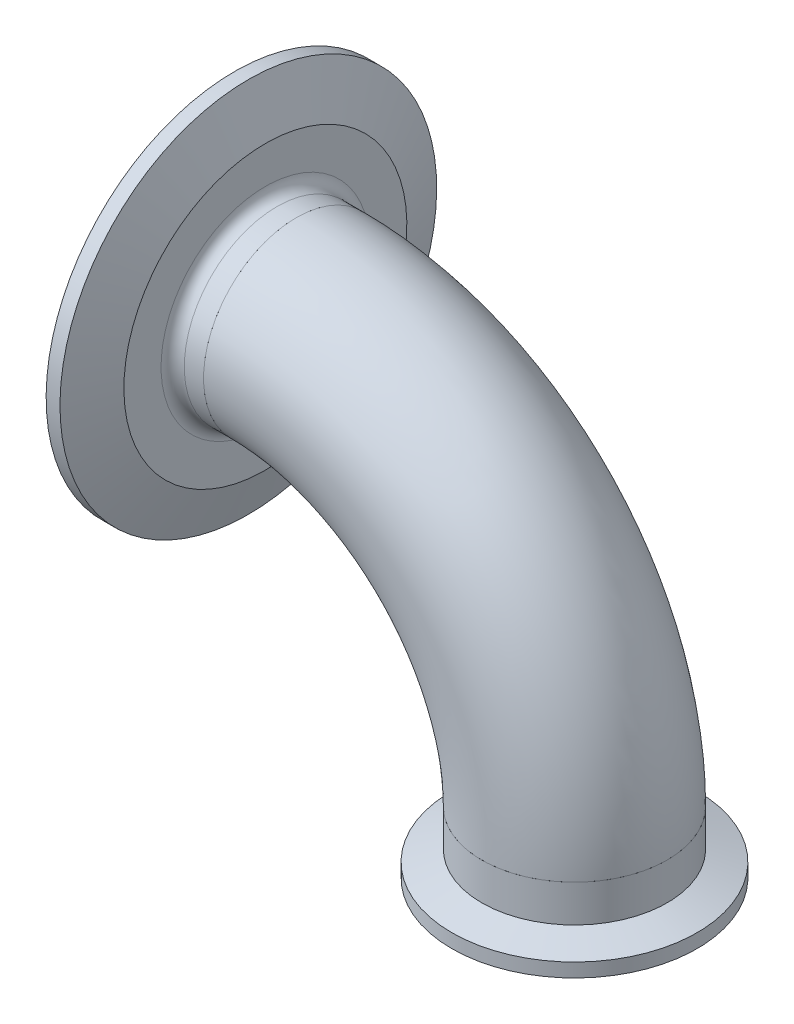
ISO-10303-21;
HEADER;
FILE_DESCRIPTION(('STEP AP214'),'2;1');
FILE_NAME('part.step','',(''),(''),'','','');
FILE_SCHEMA(('AUTOMOTIVE_DESIGN { 1 0 10303 214 1 1 1 1 }'));
ENDSEC;
DATA;
#1=APPLICATION_CONTEXT('core data for automotive mechanical design processes');
#2=APPLICATION_PROTOCOL_DEFINITION('international standard','automotive_design',2000,#1);
#3=PRODUCT_CONTEXT('',#1,'mechanical');
#4=PRODUCT('Part','Part','',(#3));
#5=PRODUCT_RELATED_PRODUCT_CATEGORY('part','',(#4));
#6=PRODUCT_DEFINITION_FORMATION('','',#4);
#7=PRODUCT_DEFINITION_CONTEXT('part definition',#1,'design');
#8=PRODUCT_DEFINITION('design','',#6,#7);
#9=PRODUCT_DEFINITION_SHAPE('','',#8);
#10=(LENGTH_UNIT() NAMED_UNIT(*) SI_UNIT(.MILLI.,.METRE.));
#11=(NAMED_UNIT(*) PLANE_ANGLE_UNIT() SI_UNIT($,.RADIAN.));
#12=(NAMED_UNIT(*) SI_UNIT($,.STERADIAN.) SOLID_ANGLE_UNIT());
#13=UNCERTAINTY_MEASURE_WITH_UNIT(LENGTH_MEASURE(1.E-05),#10,'distance_accuracy_value','');
#14=(GEOMETRIC_REPRESENTATION_CONTEXT(3) GLOBAL_UNCERTAINTY_ASSIGNED_CONTEXT((#13)) GLOBAL_UNIT_ASSIGNED_CONTEXT((#10,
#11,#12)) REPRESENTATION_CONTEXT('',''));
#15=CARTESIAN_POINT('',(0.,0.,0.));
#16=DIRECTION('',(0.,0.,1.));
#17=DIRECTION('',(1.,0.,0.));
#18=AXIS2_PLACEMENT_3D('',#15,#16,#17);
#19=CARTESIAN_POINT('',(8.93718359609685,90.2785456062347,94.8178450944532));
#20=DIRECTION('',(-1.,0.,0.));
#21=DIRECTION('',(0.,0.82925359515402,-0.558872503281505));
#22=AXIS2_PLACEMENT_3D('',#19,#20,#21);
#23=PLANE('',#22);
#24=CARTESIAN_POINT('',(8.93718359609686,80.3275971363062,80.0526531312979));
#25=DIRECTION('',(-1.,0.,0.));
#26=DIRECTION('',(0.,0.82925359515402,-0.558872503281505));
#27=AXIS2_PLACEMENT_3D('',#24,#25,#26);
#28=CIRCLE('',#27,19.05);
#29=CARTESIAN_POINT('',(8.93718359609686,96.1248781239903,69.4061319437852));
#30=VERTEX_POINT('',#29);
#31=EDGE_CURVE('P0_E9',#30,#30,#28,.T.);
#32=ORIENTED_EDGE('',*,*,#31,.F.);
#33=EDGE_LOOP('',(#32));
#34=FACE_BOUND('',#33,.T.);
#35=CARTESIAN_POINT('',(8.93718359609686,80.3275971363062,80.0526531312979));
#36=DIRECTION('',(-1.,0.,0.));
#37=DIRECTION('',(0.,0.82925359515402,-0.558872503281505));
#38=AXIS2_PLACEMENT_3D('',#35,#36,#37);
#39=CIRCLE('',#38,17.8054);
#40=CARTESIAN_POINT('',(8.93718359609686,95.0927890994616,70.1017046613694));
#41=VERTEX_POINT('',#40);
#42=EDGE_CURVE('P0_E63',#41,#41,#39,.T.);
#43=ORIENTED_EDGE('',*,*,#42,.T.);
#44=EDGE_LOOP('',(#43));
#45=FACE_BOUND('',#44,.T.);
#46=ADVANCED_FACE('P0_F14',(#34,#45),#23,.F.);
#47=CARTESIAN_POINT('',(-3.76281640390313,80.3275971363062,80.0526531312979));
#48=DIRECTION('',(-1.,0.,0.));
#49=DIRECTION('',(0.,0.82925359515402,-0.558872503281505));
#50=AXIS2_PLACEMENT_3D('',#47,#48,#49);
#51=CYLINDRICAL_SURFACE('',#50,19.05);
#52=CARTESIAN_POINT('',(4.97478359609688,80.3275971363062,80.0526531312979));
#53=DIRECTION('',(-1.,0.,0.));
#54=DIRECTION('',(0.,0.82925359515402,-0.558872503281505));
#55=AXIS2_PLACEMENT_3D('',#52,#53,#54);
#56=CIRCLE('',#55,19.05);
#57=CARTESIAN_POINT('',(4.97478359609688,96.1248781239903,69.4061319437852));
#58=VERTEX_POINT('',#57);
#59=EDGE_CURVE('P0_E20',#58,#58,#56,.T.);
#60=ORIENTED_EDGE('',*,*,#59,.F.);
#61=EDGE_LOOP('',(#60));
#62=FACE_BOUND('',#61,.T.);
#63=ORIENTED_EDGE('',*,*,#31,.T.);
#64=EDGE_LOOP('',(#63));
#65=FACE_BOUND('',#64,.T.);
#66=ADVANCED_FACE('P0_F142',(#62,#65),#51,.T.);
#67=CARTESIAN_POINT('',(4.97478359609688,80.3275971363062,80.0526531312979));
#68=DIRECTION('',(-1.,0.,0.));
#69=DIRECTION('',(0.,0.82925359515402,-0.558872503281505));
#70=AXIS2_PLACEMENT_3D('',#67,#68,#69);
#71=TOROIDAL_SURFACE('',#70,21.4376,2.3876);
#72=CARTESIAN_POINT('',(2.58718359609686,80.3275971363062,80.0526531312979));
#73=DIRECTION('',(-1.,0.,0.));
#74=DIRECTION('',(0.,0.82925359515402,-0.558872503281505));
#75=AXIS2_PLACEMENT_3D('',#72,#73,#74);
#76=CIRCLE('',#75,21.4376);
#77=CARTESIAN_POINT('',(2.58718359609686,98.10480400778,68.0717679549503));
#78=VERTEX_POINT('',#77);
#79=EDGE_CURVE('P0_E24',#78,#78,#76,.T.);
#80=ORIENTED_EDGE('',*,*,#79,.F.);
#81=EDGE_LOOP('',(#80));
#82=FACE_BOUND('',#81,.T.);
#83=ORIENTED_EDGE('',*,*,#59,.T.);
#84=EDGE_LOOP('',(#83));
#85=FACE_BOUND('',#84,.T.);
#86=ADVANCED_FACE('P0_F137',(#82,#85),#71,.F.);
#87=CARTESIAN_POINT('',(2.58718359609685,92.3084823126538,97.8298600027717));
#88=DIRECTION('',(-1.,0.,0.));
#89=DIRECTION('',(0.,0.82925359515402,-0.558872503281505));
#90=AXIS2_PLACEMENT_3D('',#87,#88,#89);
#91=PLANE('',#90);
#92=CARTESIAN_POINT('',(2.58718359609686,80.3275971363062,80.0526531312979));
#93=DIRECTION('',(-1.,0.,0.));
#94=DIRECTION('',(0.,0.82925359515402,-0.558872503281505));
#95=AXIS2_PLACEMENT_3D('',#92,#93,#94);
#96=CIRCLE('',#95,29.0664421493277);
#97=CARTESIAN_POINT('',(2.58718359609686,104.431048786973,63.8082178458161));
#98=VERTEX_POINT('',#97);
#99=EDGE_CURVE('P0_E28',#98,#98,#96,.T.);
#100=ORIENTED_EDGE('',*,*,#99,.F.);
#101=EDGE_LOOP('',(#100));
#102=FACE_BOUND('',#101,.T.);
#103=ORIENTED_EDGE('',*,*,#79,.T.);
#104=EDGE_LOOP('',(#103));
#105=FACE_BOUND('',#104,.T.);
#106=ADVANCED_FACE('P0_F131',(#102,#105),#91,.F.);
#107=CARTESIAN_POINT('',(2.58718359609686,80.3275971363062,80.0526531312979));
#108=DIRECTION('',(-1.,0.,0.));
#109=DIRECTION('',(0.,0.82925359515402,-0.558872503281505));
#110=AXIS2_PLACEMENT_3D('',#107,#108,#109);
#111=CONICAL_SURFACE('',#110,29.0664421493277,1.22173047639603);
#112=CARTESIAN_POINT('',(-0.918016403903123,80.3275971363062,80.0526531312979));
#113=DIRECTION('',(-1.,0.,0.));
#114=DIRECTION('',(0.,0.82925359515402,-0.558872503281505));
#115=AXIS2_PLACEMENT_3D('',#112,#113,#114);
#116=CIRCLE('',#115,38.6969);
#117=CARTESIAN_POINT('',(-0.918016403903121,112.417140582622,58.4260197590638));
#118=VERTEX_POINT('',#117);
#119=EDGE_CURVE('P0_E33',#118,#118,#116,.T.);
#120=ORIENTED_EDGE('',*,*,#119,.F.);
#121=EDGE_LOOP('',(#120));
#122=FACE_BOUND('',#121,.T.);
#123=ORIENTED_EDGE('',*,*,#99,.T.);
#124=EDGE_LOOP('',(#123));
#125=FACE_BOUND('',#124,.T.);
#126=ADVANCED_FACE('P0_F125',(#122,#125),#111,.T.);
#127=CARTESIAN_POINT('',(-3.76281640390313,80.3275971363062,80.0526531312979));
#128=DIRECTION('',(-1.,0.,0.));
#129=DIRECTION('',(0.,0.82925359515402,-0.558872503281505));
#130=AXIS2_PLACEMENT_3D('',#127,#128,#129);
#131=CYLINDRICAL_SURFACE('',#130,38.6969);
#132=CARTESIAN_POINT('',(-3.76281640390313,80.3275971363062,80.0526531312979));
#133=DIRECTION('',(-1.,0.,0.));
#134=DIRECTION('',(0.,0.82925359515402,-0.558872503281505));
#135=AXIS2_PLACEMENT_3D('',#132,#133,#134);
#136=CIRCLE('',#135,38.6969);
#137=CARTESIAN_POINT('',(-3.76281640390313,112.417140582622,58.4260197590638));
#138=VERTEX_POINT('',#137);
#139=EDGE_CURVE('P0_E36',#138,#138,#136,.T.);
#140=ORIENTED_EDGE('',*,*,#139,.F.);
#141=EDGE_LOOP('',(#140));
#142=FACE_BOUND('',#141,.T.);
#143=ORIENTED_EDGE('',*,*,#119,.T.);
#144=EDGE_LOOP('',(#143));
#145=FACE_BOUND('',#144,.T.);
#146=ADVANCED_FACE('P0_F119',(#142,#145),#131,.T.);
#147=CARTESIAN_POINT('',(-3.76281640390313,80.3275971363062,80.0526531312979));
#148=DIRECTION('',(-1.,0.,0.));
#149=DIRECTION('',(0.,0.82925359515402,-0.558872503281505));
#150=AXIS2_PLACEMENT_3D('',#147,#148,#149);
#151=CONICAL_SURFACE('',#150,38.6969,1.56939586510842);
#152=CARTESIAN_POINT('',(-3.76030393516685,80.3275971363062,80.0526531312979));
#153=DIRECTION('',(-1.,0.,0.));
#154=DIRECTION('',(0.,0.82925359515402,-0.558872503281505));
#155=AXIS2_PLACEMENT_3D('',#152,#153,#154);
#156=CIRCLE('',#155,36.9028722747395);
#157=CARTESIAN_POINT('',(-3.76030393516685,110.929436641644,59.4286525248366));
#158=VERTEX_POINT('',#157);
#159=EDGE_CURVE('P0_E39',#158,#158,#156,.T.);
#160=ORIENTED_EDGE('',*,*,#159,.F.);
#161=EDGE_LOOP('',(#160));
#162=FACE_BOUND('',#161,.T.);
#163=ORIENTED_EDGE('',*,*,#139,.T.);
#164=EDGE_LOOP('',(#163));
#165=FACE_BOUND('',#164,.T.);
#166=ADVANCED_FACE('P0_F113',(#162,#165),#151,.F.);
#167=CARTESIAN_POINT('',(-2.97290393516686,80.3275971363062,80.0526531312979));
#168=DIRECTION('',(-1.,0.,0.));
#169=DIRECTION('',(0.,0.82925359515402,-0.558872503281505));
#170=AXIS2_PLACEMENT_3D('',#167,#168,#169);
#171=TOROIDAL_SURFACE('',#170,36.9028722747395,0.787400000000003);
#172=CARTESIAN_POINT('',(-3.2805656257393,80.3275971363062,80.0526531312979));
#173=DIRECTION('',(-1.,0.,0.));
#174=DIRECTION('',(0.,0.82925359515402,-0.558872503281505));
#175=AXIS2_PLACEMENT_3D('',#172,#173,#174);
#176=CIRCLE('',#175,36.178066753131);
#177=CARTESIAN_POINT('',(-3.2805656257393,110.328389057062,59.8337264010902));
#178=VERTEX_POINT('',#177);
#179=EDGE_CURVE('P0_E42',#178,#178,#176,.T.);
#180=ORIENTED_EDGE('',*,*,#179,.F.);
#181=EDGE_LOOP('',(#180));
#182=FACE_BOUND('',#181,.T.);
#183=ORIENTED_EDGE('',*,*,#159,.T.);
#184=EDGE_LOOP('',(#183));
#185=FACE_BOUND('',#184,.T.);
#186=ADVANCED_FACE('P0_F107',(#182,#185),#171,.T.);
#187=CARTESIAN_POINT('',(-3.2805656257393,80.3275971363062,80.0526531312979));
#188=DIRECTION('',(-1.,0.,0.));
#189=DIRECTION('',(0.,0.82925359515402,-0.558872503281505));
#190=AXIS2_PLACEMENT_3D('',#187,#188,#189);
#191=CONICAL_SURFACE('',#190,36.178066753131,0.401425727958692);
#192=CARTESIAN_POINT('',(-3.03361896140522,80.3275971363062,80.0526531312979));
#193=DIRECTION('',(-1.,0.,0.));
#194=DIRECTION('',(0.,0.82925359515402,-0.558872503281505));
#195=AXIS2_PLACEMENT_3D('',#192,#193,#194);
#196=CIRCLE('',#195,36.0732441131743);
#197=CARTESIAN_POINT('',(-3.03361896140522,110.241464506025,59.8923088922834));
#198=VERTEX_POINT('',#197);
#199=EDGE_CURVE('P0_E45',#198,#198,#196,.T.);
#200=ORIENTED_EDGE('',*,*,#199,.F.);
#201=EDGE_LOOP('',(#200));
#202=FACE_BOUND('',#201,.T.);
#203=ORIENTED_EDGE('',*,*,#179,.T.);
#204=EDGE_LOOP('',(#203));
#205=FACE_BOUND('',#204,.T.);
#206=ADVANCED_FACE('P0_F101',(#202,#205),#191,.F.);
#207=CARTESIAN_POINT('',(-3.35390393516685,80.3275971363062,80.0526531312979));
#208=DIRECTION('',(-1.,0.,0.));
#209=DIRECTION('',(0.,0.82925359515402,-0.558872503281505));
#210=AXIS2_PLACEMENT_3D('',#207,#208,#209);
#211=TOROIDAL_SURFACE('',#210,35.3187,0.81970682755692);
#212=CARTESIAN_POINT('',(-3.03361896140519,80.3275971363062,80.0526531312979));
#213=DIRECTION('',(-1.,0.,0.));
#214=DIRECTION('',(0.,0.82925359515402,-0.558872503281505));
#215=AXIS2_PLACEMENT_3D('',#212,#213,#214);
#216=CIRCLE('',#215,34.5641558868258);
#217=CARTESIAN_POINT('',(-3.03361896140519,108.99004766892,60.7356968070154));
#218=VERTEX_POINT('',#217);
#219=EDGE_CURVE('P0_E48',#218,#218,#216,.T.);
#220=ORIENTED_EDGE('',*,*,#219,.F.);
#221=EDGE_LOOP('',(#220));
#222=FACE_BOUND('',#221,.T.);
#223=ORIENTED_EDGE('',*,*,#199,.T.);
#224=EDGE_LOOP('',(#223));
#225=FACE_BOUND('',#224,.T.);
#226=ADVANCED_FACE('P0_F95',(#222,#225),#211,.F.);
#227=CARTESIAN_POINT('',(-3.03361896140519,80.3275971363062,80.0526531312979));
#228=DIRECTION('',(1.,0.,0.));
#229=DIRECTION('',(0.,-0.82925359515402,0.558872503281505));
#230=AXIS2_PLACEMENT_3D('',#227,#228,#229);
#231=CONICAL_SURFACE('',#230,34.5641558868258,0.401425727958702);
#232=CARTESIAN_POINT('',(-3.42673547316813,80.3275971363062,80.0526531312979));
#233=DIRECTION('',(-1.,0.,0.));
#234=DIRECTION('',(0.,0.82925359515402,-0.558872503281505));
#235=AXIS2_PLACEMENT_3D('',#232,#233,#234);
#236=CIRCLE('',#235,34.3972878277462);
#237=CARTESIAN_POINT('',(-3.42673547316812,108.851671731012,60.8289547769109));
#238=VERTEX_POINT('',#237);
#239=EDGE_CURVE('P0_E51',#238,#238,#236,.T.);
#240=ORIENTED_EDGE('',*,*,#239,.F.);
#241=EDGE_LOOP('',(#240));
#242=FACE_BOUND('',#241,.T.);
#243=ORIENTED_EDGE('',*,*,#219,.T.);
#244=EDGE_LOOP('',(#243));
#245=FACE_BOUND('',#244,.T.);
#246=ADVANCED_FACE('P0_F89',(#242,#245),#231,.T.);
#247=CARTESIAN_POINT('',(-3.11907378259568,80.3275971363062,80.0526531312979));
#248=DIRECTION('',(-1.,0.,0.));
#249=DIRECTION('',(0.,0.82925359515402,-0.558872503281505));
#250=AXIS2_PLACEMENT_3D('',#247,#248,#249);
#251=TOROIDAL_SURFACE('',#250,33.6724823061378,0.7874);
#252=CARTESIAN_POINT('',(-3.90647378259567,80.3275971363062,80.0526531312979));
#253=DIRECTION('',(-1.,0.,0.));
#254=DIRECTION('',(0.,0.82925359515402,-0.558872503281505));
#255=AXIS2_PLACEMENT_3D('',#252,#253,#254);
#256=CIRCLE('',#255,33.6724823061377);
#257=CARTESIAN_POINT('',(-3.90647378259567,108.250624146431,61.2340286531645));
#258=VERTEX_POINT('',#257);
#259=EDGE_CURVE('P0_E54',#258,#258,#256,.T.);
#260=ORIENTED_EDGE('',*,*,#259,.F.);
#261=EDGE_LOOP('',(#260));
#262=FACE_BOUND('',#261,.T.);
#263=ORIENTED_EDGE('',*,*,#239,.T.);
#264=EDGE_LOOP('',(#263));
#265=FACE_BOUND('',#264,.T.);
#266=ADVANCED_FACE('P0_F83',(#262,#265),#251,.T.);
#267=CARTESIAN_POINT('',(-3.90647378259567,80.3275971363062,80.0526531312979));
#268=DIRECTION('',(-1.,0.,0.));
#269=DIRECTION('',(0.,0.82925359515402,-0.558872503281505));
#270=AXIS2_PLACEMENT_3D('',#267,#268,#269);
#271=CONICAL_SURFACE('',#270,33.6724823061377,1.53061701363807);
#272=CARTESIAN_POINT('',(-3.76281640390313,80.3275971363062,80.0526531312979));
#273=DIRECTION('',(-1.,0.,0.));
#274=DIRECTION('',(0.,0.82925359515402,-0.558872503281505));
#275=AXIS2_PLACEMENT_3D('',#272,#273,#274);
#276=CIRCLE('',#275,30.099);
#277=CARTESIAN_POINT('',(-3.76281640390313,105.287301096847,63.2311496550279));
#278=VERTEX_POINT('',#277);
#279=EDGE_CURVE('P0_E57',#278,#278,#276,.T.);
#280=ORIENTED_EDGE('',*,*,#279,.F.);
#281=EDGE_LOOP('',(#280));
#282=FACE_BOUND('',#281,.T.);
#283=ORIENTED_EDGE('',*,*,#259,.T.);
#284=EDGE_LOOP('',(#283));
#285=FACE_BOUND('',#284,.T.);
#286=ADVANCED_FACE('P0_F77',(#282,#285),#271,.F.);
#287=CARTESIAN_POINT('',(-3.76281640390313,80.3275971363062,80.0526531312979));
#288=DIRECTION('',(-1.,0.,0.));
#289=DIRECTION('',(0.,0.82925359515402,-0.558872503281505));
#290=AXIS2_PLACEMENT_3D('',#287,#288,#289);
#291=CONICAL_SURFACE('',#290,30.099,1.11526539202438);
#292=CARTESIAN_POINT('',(2.25975609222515,80.3275971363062,80.0526531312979));
#293=DIRECTION('',(-1.,0.,0.));
#294=DIRECTION('',(0.,0.82925359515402,-0.558872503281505));
#295=AXIS2_PLACEMENT_3D('',#292,#293,#294);
#296=CIRCLE('',#295,17.8054);
#297=CARTESIAN_POINT('',(2.25975609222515,95.0927890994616,70.1017046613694));
#298=VERTEX_POINT('',#297);
#299=EDGE_CURVE('P0_E60',#298,#298,#296,.T.);
#300=ORIENTED_EDGE('',*,*,#299,.F.);
#301=EDGE_LOOP('',(#300));
#302=FACE_BOUND('',#301,.T.);
#303=ORIENTED_EDGE('',*,*,#279,.T.);
#304=EDGE_LOOP('',(#303));
#305=FACE_BOUND('',#304,.T.);
#306=ADVANCED_FACE('P0_F71',(#302,#305),#291,.F.);
#307=CARTESIAN_POINT('',(-3.76281640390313,80.3275971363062,80.0526531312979));
#308=DIRECTION('',(-1.,0.,0.));
#309=DIRECTION('',(0.,0.82925359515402,-0.558872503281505));
#310=AXIS2_PLACEMENT_3D('',#307,#308,#309);
#311=CYLINDRICAL_SURFACE('',#310,17.8054);
#312=ORIENTED_EDGE('',*,*,#42,.F.);
#313=EDGE_LOOP('',(#312));
#314=FACE_BOUND('',#313,.T.);
#315=ORIENTED_EDGE('',*,*,#299,.T.);
#316=EDGE_LOOP('',(#315));
#317=FACE_BOUND('',#316,.T.);
#318=ADVANCED_FACE('P0_F68',(#314,#317),#311,.F.);
#319=CLOSED_SHELL('',(#46,#66,#86,#106,#126,#146,#166,#186,#206,#226,#246,#266,#286,#306,#318));
#320=MANIFOLD_SOLID_BREP('P0_B1',#319);
#321=CARTESIAN_POINT('',(66.087183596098,11.4615960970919,80.0526531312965));
#322=DIRECTION('',(0.,1.00000000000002,0.));
#323=DIRECTION('',(0.,0.,1.00000000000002));
#324=AXIS2_PLACEMENT_3D('',#321,#322,#323);
#325=CONICAL_SURFACE('',#324,20.9336326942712,0.401425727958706);
#326=CARTESIAN_POINT('',(66.0871835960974,10.9418600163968,80.0526531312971));
#327=DIRECTION('',(0.,-1.00000000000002,0.));
#328=DIRECTION('',(0.,0.,-1.00000000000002));
#329=AXIS2_PLACEMENT_3D('',#326,#327,#328);
#330=CIRCLE('',#329,20.7130178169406);
#331=CARTESIAN_POINT('',(66.0871835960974,10.9418600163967,59.3396353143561));
#332=VERTEX_POINT('',#331);
#333=EDGE_CURVE('P1_E10',#332,#332,#330,.T.);
#334=ORIENTED_EDGE('',*,*,#333,.F.);
#335=EDGE_LOOP('',(#334));
#336=FACE_BOUND('',#335,.T.);
#337=CARTESIAN_POINT('',(66.087183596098,11.4615960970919,80.0526531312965));
#338=DIRECTION('',(0.,-1.00000000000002,0.));
#339=DIRECTION('',(0.,0.,-1.00000000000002));
#340=AXIS2_PLACEMENT_3D('',#337,#338,#339);
#341=CIRCLE('',#340,20.9336326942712);
#342=CARTESIAN_POINT('',(66.087183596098,11.4615960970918,59.119020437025));
#343=VERTEX_POINT('',#342);
#344=EDGE_CURVE('P1_E55',#343,#343,#341,.T.);
#345=ORIENTED_EDGE('',*,*,#344,.T.);
#346=EDGE_LOOP('',(#345));
#347=FACE_BOUND('',#346,.T.);
#348=ADVANCED_FACE('P1_F15',(#336,#347),#325,.T.);
#349=CARTESIAN_POINT('',(66.0871835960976,11.2395971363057,80.0526531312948));
#350=DIRECTION('',(0.,-1.00000000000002,0.));
#351=DIRECTION('',(0.,0.,-1.00000000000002));
#352=AXIS2_PLACEMENT_3D('',#349,#350,#351);
#353=TOROIDAL_SURFACE('',#352,20.0115931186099,0.761999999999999);
#354=CARTESIAN_POINT('',(66.0871835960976,10.4775971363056,80.0526531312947));
#355=DIRECTION('',(0.,-1.00000000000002,0.));
#356=DIRECTION('',(0.,0.,-1.00000000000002));
#357=AXIS2_PLACEMENT_3D('',#354,#355,#356);
#358=CIRCLE('',#357,20.0115931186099);
#359=CARTESIAN_POINT('',(66.0871835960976,10.4775971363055,60.0410600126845));
#360=VERTEX_POINT('',#359);
#361=EDGE_CURVE('P1_E21',#360,#360,#358,.T.);
#362=ORIENTED_EDGE('',*,*,#361,.F.);
#363=EDGE_LOOP('',(#362));
#364=FACE_BOUND('',#363,.T.);
#365=ORIENTED_EDGE('',*,*,#333,.T.);
#366=EDGE_LOOP('',(#365));
#367=FACE_BOUND('',#366,.T.);
#368=ADVANCED_FACE('P1_F85',(#364,#367),#353,.T.);
#369=CARTESIAN_POINT('',(66.0871835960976,10.4775971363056,80.0526531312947));
#370=DIRECTION('',(0.,1.00000000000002,0.));
#371=DIRECTION('',(0.,0.,1.00000000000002));
#372=AXIS2_PLACEMENT_3D('',#369,#370,#371);
#373=PLANE('',#372);
#374=CARTESIAN_POINT('',(66.0871835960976,10.4775971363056,80.0526531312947));
#375=DIRECTION('',(0.,-1.00000000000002,0.));
#376=DIRECTION('',(0.,0.,-1.00000000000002));
#377=AXIS2_PLACEMENT_3D('',#374,#375,#376);
#378=CIRCLE('',#377,17.399);
#379=CARTESIAN_POINT('',(66.0871835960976,10.4775971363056,62.6536531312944));
#380=VERTEX_POINT('',#379);
#381=EDGE_CURVE('P1_E25',#380,#380,#378,.T.);
#382=ORIENTED_EDGE('',*,*,#381,.F.);
#383=EDGE_LOOP('',(#382));
#384=FACE_BOUND('',#383,.T.);
#385=ORIENTED_EDGE('',*,*,#361,.T.);
#386=EDGE_LOOP('',(#385));
#387=FACE_BOUND('',#386,.T.);
#388=ADVANCED_FACE('P1_F90',(#384,#387),#373,.F.);
#389=CARTESIAN_POINT('',(66.0871835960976,10.4775971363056,80.0526531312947));
#390=DIRECTION('',(0.,-1.00000000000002,0.));
#391=DIRECTION('',(0.,0.,-1.00000000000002));
#392=AXIS2_PLACEMENT_3D('',#389,#390,#391);
#393=CYLINDRICAL_SURFACE('',#392,17.399);
#394=ORIENTED_EDGE('',*,*,#381,.T.);
#395=EDGE_LOOP('',(#394));
#396=FACE_BOUND('',#395,.T.);
#397=CARTESIAN_POINT('',(66.0871835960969,23.1775971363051,80.052653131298));
#398=DIRECTION('',(0.,-1.00000000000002,0.));
#399=DIRECTION('',(0.,0.,-1.00000000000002));
#400=AXIS2_PLACEMENT_3D('',#397,#398,#399);
#401=CIRCLE('',#400,17.399);
#402=CARTESIAN_POINT('',(66.0871835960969,23.177597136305,62.6536531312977));
#403=VERTEX_POINT('',#402);
#404=EDGE_CURVE('P1_E29',#403,#403,#401,.T.);
#405=ORIENTED_EDGE('',*,*,#404,.F.);
#406=EDGE_LOOP('',(#405));
#407=FACE_BOUND('',#406,.T.);
#408=ADVANCED_FACE('P1_F95',(#396,#407),#393,.F.);
#409=CARTESIAN_POINT('',(66.0871835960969,23.1775971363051,80.052653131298));
#410=DIRECTION('',(0.,-1.00000000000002,0.));
#411=DIRECTION('',(0.,0.,-1.00000000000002));
#412=AXIS2_PLACEMENT_3D('',#409,#410,#411);
#413=PLANE('',#412);
#414=CARTESIAN_POINT('',(66.0871835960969,23.1775971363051,80.052653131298));
#415=DIRECTION('',(0.,-1.00000000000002,0.));
#416=DIRECTION('',(0.,0.,-1.00000000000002));
#417=AXIS2_PLACEMENT_3D('',#414,#415,#416);
#418=CIRCLE('',#417,19.05);
#419=CARTESIAN_POINT('',(66.0871835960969,23.177597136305,61.0026531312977));
#420=VERTEX_POINT('',#419);
#421=EDGE_CURVE('P1_E34',#420,#420,#418,.T.);
#422=ORIENTED_EDGE('',*,*,#421,.F.);
#423=EDGE_LOOP('',(#422));
#424=FACE_BOUND('',#423,.T.);
#425=ORIENTED_EDGE('',*,*,#404,.T.);
#426=EDGE_LOOP('',(#425));
#427=FACE_BOUND('',#426,.T.);
#428=ADVANCED_FACE('P1_F101',(#424,#427),#413,.F.);
#429=CARTESIAN_POINT('',(66.0871835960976,10.4775971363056,80.0526531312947));
#430=DIRECTION('',(0.,-1.00000000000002,0.));
#431=DIRECTION('',(0.,0.,-1.00000000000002));
#432=AXIS2_PLACEMENT_3D('',#429,#430,#431);
#433=CYLINDRICAL_SURFACE('',#432,19.05);
#434=CARTESIAN_POINT('',(66.0871835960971,15.5596493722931,80.0526531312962));
#435=DIRECTION('',(0.,-1.00000000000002,0.));
#436=DIRECTION('',(0.,0.,-1.00000000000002));
#437=AXIS2_PLACEMENT_3D('',#434,#435,#436);
#438=CIRCLE('',#437,19.05);
#439=CARTESIAN_POINT('',(66.0871835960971,15.559649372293,61.0026531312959));
#440=VERTEX_POINT('',#439);
#441=EDGE_CURVE('P1_E37',#440,#440,#438,.T.);
#442=ORIENTED_EDGE('',*,*,#441,.F.);
#443=EDGE_LOOP('',(#442));
#444=FACE_BOUND('',#443,.T.);
#445=ORIENTED_EDGE('',*,*,#421,.T.);
#446=EDGE_LOOP('',(#445));
#447=FACE_BOUND('',#446,.T.);
#448=ADVANCED_FACE('P1_F105',(#444,#447),#433,.T.);
#449=CARTESIAN_POINT('',(66.0871835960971,15.5596493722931,80.0526531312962));
#450=DIRECTION('',(0.,-1.00000000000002,0.));
#451=DIRECTION('',(0.,0.,-1.00000000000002));
#452=AXIS2_PLACEMENT_3D('',#449,#450,#451);
#453=CONICAL_SURFACE('',#452,19.05,1.22173047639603);
#454=CARTESIAN_POINT('',(66.0871835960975,13.3223971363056,80.0526531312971));
#455=DIRECTION('',(0.,-1.00000000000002,0.));
#456=DIRECTION('',(0.,0.,-1.00000000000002));
#457=AXIS2_PLACEMENT_3D('',#454,#455,#456);
#458=CIRCLE('',#457,25.1968);
#459=CARTESIAN_POINT('',(66.0871835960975,13.3223971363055,54.8558531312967));
#460=VERTEX_POINT('',#459);
#461=EDGE_CURVE('P1_E40',#460,#460,#458,.T.);
#462=ORIENTED_EDGE('',*,*,#461,.F.);
#463=EDGE_LOOP('',(#462));
#464=FACE_BOUND('',#463,.T.);
#465=ORIENTED_EDGE('',*,*,#441,.T.);
#466=EDGE_LOOP('',(#465));
#467=FACE_BOUND('',#466,.T.);
#468=ADVANCED_FACE('P1_F109',(#464,#467),#453,.T.);
#469=CARTESIAN_POINT('',(66.0871835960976,10.4775971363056,80.0526531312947));
#470=DIRECTION('',(0.,-1.00000000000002,0.));
#471=DIRECTION('',(0.,0.,-1.00000000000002));
#472=AXIS2_PLACEMENT_3D('',#469,#470,#471);
#473=CYLINDRICAL_SURFACE('',#472,25.1968);
#474=CARTESIAN_POINT('',(66.0871835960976,10.4775971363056,80.0526531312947));
#475=DIRECTION('',(0.,-1.00000000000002,0.));
#476=DIRECTION('',(0.,0.,-1.00000000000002));
#477=AXIS2_PLACEMENT_3D('',#474,#475,#476);
#478=CIRCLE('',#477,25.1968);
#479=CARTESIAN_POINT('',(66.0871835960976,10.4775971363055,54.8558531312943));
#480=VERTEX_POINT('',#479);
#481=EDGE_CURVE('P1_E43',#480,#480,#478,.T.);
#482=ORIENTED_EDGE('',*,*,#481,.F.);
#483=EDGE_LOOP('',(#482));
#484=FACE_BOUND('',#483,.T.);
#485=ORIENTED_EDGE('',*,*,#461,.T.);
#486=EDGE_LOOP('',(#485));
#487=FACE_BOUND('',#486,.T.);
#488=ADVANCED_FACE('P1_F81',(#484,#487),#473,.T.);
#489=CARTESIAN_POINT('',(66.0871835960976,10.4775971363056,80.0526531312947));
#490=DIRECTION('',(0.,1.00000000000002,0.));
#491=DIRECTION('',(0.,0.,1.00000000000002));
#492=AXIS2_PLACEMENT_3D('',#489,#490,#491);
#493=PLANE('',#492);
#494=CARTESIAN_POINT('',(66.0871835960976,10.4775971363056,80.0526531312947));
#495=DIRECTION('',(0.,-1.00000000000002,0.));
#496=DIRECTION('',(0.,0.,-1.00000000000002));
#497=AXIS2_PLACEMENT_3D('',#494,#495,#496);
#498=CIRCLE('',#497,23.9521599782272);
#499=CARTESIAN_POINT('',(66.0871835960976,10.4775971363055,56.1004931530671));
#500=VERTEX_POINT('',#499);
#501=EDGE_CURVE('P1_E46',#500,#500,#498,.T.);
#502=ORIENTED_EDGE('',*,*,#501,.F.);
#503=EDGE_LOOP('',(#502));
#504=FACE_BOUND('',#503,.T.);
#505=ORIENTED_EDGE('',*,*,#481,.T.);
#506=EDGE_LOOP('',(#505));
#507=FACE_BOUND('',#506,.T.);
#508=ADVANCED_FACE('P1_F74',(#504,#507),#493,.F.);
#509=CARTESIAN_POINT('',(66.0871835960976,11.2395971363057,80.0526531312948));
#510=DIRECTION('',(0.,-1.00000000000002,0.));
#511=DIRECTION('',(0.,0.,-1.00000000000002));
#512=AXIS2_PLACEMENT_3D('',#509,#510,#511);
#513=TOROIDAL_SURFACE('',#512,23.9521599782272,0.761999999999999);
#514=ORIENTED_EDGE('',*,*,#501,.T.);
#515=EDGE_LOOP('',(#514));
#516=FACE_BOUND('',#515,.T.);
#517=CARTESIAN_POINT('',(66.0871835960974,10.9418600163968,80.0526531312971));
#518=DIRECTION('',(0.,-1.00000000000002,0.));
#519=DIRECTION('',(0.,0.,-1.00000000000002));
#520=AXIS2_PLACEMENT_3D('',#517,#518,#519);
#521=CIRCLE('',#520,23.2507352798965);
#522=CARTESIAN_POINT('',(66.0871835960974,10.9418600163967,56.8019178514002));
#523=VERTEX_POINT('',#522);
#524=EDGE_CURVE('P1_E49',#523,#523,#521,.T.);
#525=ORIENTED_EDGE('',*,*,#524,.F.);
#526=EDGE_LOOP('',(#525));
#527=FACE_BOUND('',#526,.T.);
#528=ADVANCED_FACE('P1_F69',(#516,#527),#513,.T.);
#529=CARTESIAN_POINT('',(66.0871835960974,10.9418600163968,80.0526531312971));
#530=DIRECTION('',(0.,-1.00000000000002,0.));
#531=DIRECTION('',(0.,0.,-1.00000000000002));
#532=AXIS2_PLACEMENT_3D('',#529,#530,#531);
#533=CONICAL_SURFACE('',#532,23.2507352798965,0.401425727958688);
#534=CARTESIAN_POINT('',(66.0871835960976,11.350451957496,80.0526531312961));
#535=DIRECTION('',(0.,-1.00000000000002,0.));
#536=DIRECTION('',(0.,0.,-1.00000000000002));
#537=AXIS2_PLACEMENT_3D('',#534,#535,#536);
#538=CIRCLE('',#537,23.0772982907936);
#539=CARTESIAN_POINT('',(66.0871835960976,11.3504519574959,56.9753548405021));
#540=VERTEX_POINT('',#539);
#541=EDGE_CURVE('P1_E52',#540,#540,#538,.T.);
#542=ORIENTED_EDGE('',*,*,#541,.F.);
#543=EDGE_LOOP('',(#542));
#544=FACE_BOUND('',#543,.T.);
#545=ORIENTED_EDGE('',*,*,#524,.T.);
#546=EDGE_LOOP('',(#545));
#547=FACE_BOUND('',#546,.T.);
#548=ADVANCED_FACE('P1_F63',(#544,#547),#533,.F.);
#549=CARTESIAN_POINT('',(66.0871835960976,10.8839971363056,80.0526531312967));
#550=DIRECTION('',(0.,-1.00000000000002,0.));
#551=DIRECTION('',(0.,0.,-1.00000000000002));
#552=AXIS2_PLACEMENT_3D('',#549,#550,#551);
#553=TOROIDAL_SURFACE('',#552,21.9783995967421,1.1938);
#554=ORIENTED_EDGE('',*,*,#344,.F.);
#555=EDGE_LOOP('',(#554));
#556=FACE_BOUND('',#555,.T.);
#557=ORIENTED_EDGE('',*,*,#541,.T.);
#558=EDGE_LOOP('',(#557));
#559=FACE_BOUND('',#558,.T.);
#560=ADVANCED_FACE('P1_F60',(#556,#559),#553,.F.);
#561=CLOSED_SHELL('',(#348,#368,#388,#408,#428,#448,#468,#488,#508,#528,#548,#560));
#562=MANIFOLD_SOLID_BREP('P1_B1',#561);
#563=CARTESIAN_POINT('',(8.93718359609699,23.1775971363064,80.0526531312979));
#564=DIRECTION('',(0.,0.,-1.));
#565=DIRECTION('',(-1.,0.,0.));
#566=AXIS2_PLACEMENT_3D('',#563,#564,#565);
#567=TOROIDAL_SURFACE('',#566,57.15,19.05);
#568=CARTESIAN_POINT('',(8.93718359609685,80.3275971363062,80.0526531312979));
#569=DIRECTION('',(-1.,0.,0.));
#570=DIRECTION('',(0.,0.,1.));
#571=AXIS2_PLACEMENT_3D('',#568,#569,#570);
#572=CIRCLE('',#571,19.05);
#573=CARTESIAN_POINT('',(8.93718359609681,99.3775971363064,80.0526531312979));
#574=VERTEX_POINT('',#573);
#575=EDGE_CURVE('P2_E10',#574,#574,#572,.T.);
#576=CARTESIAN_POINT('',(66.087183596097,23.1775971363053,80.0526531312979));
#577=DIRECTION('',(0.,1.,0.));
#578=DIRECTION('',(0.,0.,1.));
#579=AXIS2_PLACEMENT_3D('',#576,#577,#578);
#580=CIRCLE('',#579,19.05);
#581=CARTESIAN_POINT('',(85.137183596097,23.1775971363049,80.0526531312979));
#582=VERTEX_POINT('',#581);
#583=EDGE_CURVE('P2_E21',#582,#582,#580,.T.);
#584=CARTESIAN_POINT('',(8.93718359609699,23.1775971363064,80.0526531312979));
#585=DIRECTION('',(0.,0.,-1.));
#586=DIRECTION('',(-1.,0.,0.));
#587=AXIS2_PLACEMENT_3D('',#584,#585,#586);
#588=CIRCLE('',#587,76.2);
#589=EDGE_CURVE('',#574,#582,#588,.T.);
#590=ORIENTED_EDGE('',*,*,#575,.F.);
#591=ORIENTED_EDGE('',*,*,#583,.T.);
#592=ORIENTED_EDGE('',*,*,#589,.T.);
#593=ORIENTED_EDGE('',*,*,#589,.F.);
#594=EDGE_LOOP('',(#590,#592,#591,#593));
#595=FACE_BOUND('',#594,.T.);
#596=ADVANCED_FACE('P2_F15',(#595),#567,.T.);
#597=CARTESIAN_POINT('',(8.93718359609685,80.3275971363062,80.0526531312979));
#598=DIRECTION('',(-1.,0.,0.));
#599=DIRECTION('',(0.,0.,1.));
#600=AXIS2_PLACEMENT_3D('',#597,#598,#599);
#601=PLANE('',#600);
#602=CARTESIAN_POINT('',(8.93718359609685,80.3275971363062,80.0526531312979));
#603=DIRECTION('',(-1.,0.,0.));
#604=DIRECTION('',(0.,-1.,0.));
#605=AXIS2_PLACEMENT_3D('',#602,#603,#604);
#606=CIRCLE('',#605,17.399);
#607=CARTESIAN_POINT('',(8.93718359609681,97.7265971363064,80.0526531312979));
#608=VERTEX_POINT('',#607);
#609=EDGE_CURVE('P2_E25',#608,#608,#606,.T.);
#610=ORIENTED_EDGE('',*,*,#609,.F.);
#611=EDGE_LOOP('',(#610));
#612=FACE_BOUND('',#611,.T.);
#613=ORIENTED_EDGE('',*,*,#575,.T.);
#614=EDGE_LOOP('',(#613));
#615=FACE_BOUND('',#614,.T.);
#616=ADVANCED_FACE('P2_F46',(#612,#615),#601,.T.);
#617=CARTESIAN_POINT('',(66.087183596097,23.1775971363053,80.0526531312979));
#618=DIRECTION('',(0.,1.,0.));
#619=DIRECTION('',(0.,0.,1.));
#620=AXIS2_PLACEMENT_3D('',#617,#618,#619);
#621=PLANE('',#620);
#622=CARTESIAN_POINT('',(66.087183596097,23.1775971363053,80.0526531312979));
#623=DIRECTION('',(0.,1.,0.));
#624=DIRECTION('',(0.,0.,1.));
#625=AXIS2_PLACEMENT_3D('',#622,#623,#624);
#626=CIRCLE('',#625,17.399);
#627=CARTESIAN_POINT('',(83.486183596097,23.177597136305,80.0526531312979));
#628=VERTEX_POINT('',#627);
#629=EDGE_CURVE('P2_E29',#628,#628,#626,.T.);
#630=ORIENTED_EDGE('',*,*,#629,.T.);
#631=EDGE_LOOP('',(#630));
#632=FACE_BOUND('',#631,.T.);
#633=ORIENTED_EDGE('',*,*,#583,.F.);
#634=EDGE_LOOP('',(#633));
#635=FACE_BOUND('',#634,.T.);
#636=ADVANCED_FACE('P2_F35',(#632,#635),#621,.F.);
#637=CARTESIAN_POINT('',(8.93718359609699,23.1775971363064,80.0526531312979));
#638=DIRECTION('',(0.,0.,-1.));
#639=DIRECTION('',(-1.,0.,0.));
#640=AXIS2_PLACEMENT_3D('',#637,#638,#639);
#641=TOROIDAL_SURFACE('',#640,57.15,17.399);
#642=CARTESIAN_POINT('',(8.93718359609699,23.1775971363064,80.0526531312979));
#643=DIRECTION('',(0.,0.,-1.));
#644=DIRECTION('',(-1.,0.,0.));
#645=AXIS2_PLACEMENT_3D('',#642,#643,#644);
#646=CIRCLE('',#645,74.549);
#647=EDGE_CURVE('',#608,#628,#646,.T.);
#648=ORIENTED_EDGE('',*,*,#609,.T.);
#649=ORIENTED_EDGE('',*,*,#629,.F.);
#650=ORIENTED_EDGE('',*,*,#647,.T.);
#651=ORIENTED_EDGE('',*,*,#647,.F.);
#652=EDGE_LOOP('',(#648,#650,#649,#651));
#653=FACE_BOUND('',#652,.T.);
#654=ADVANCED_FACE('P2_F38',(#653),#641,.F.);
#655=CLOSED_SHELL('',(#596,#616,#636,#654));
#656=MANIFOLD_SOLID_BREP('P2_B1',#655);
#657=ADVANCED_BREP_SHAPE_REPRESENTATION('',(#18,#320,#562,#656),#14);
#658=SHAPE_DEFINITION_REPRESENTATION(#9,#657);
ENDSEC;
END-ISO-10303-21;
